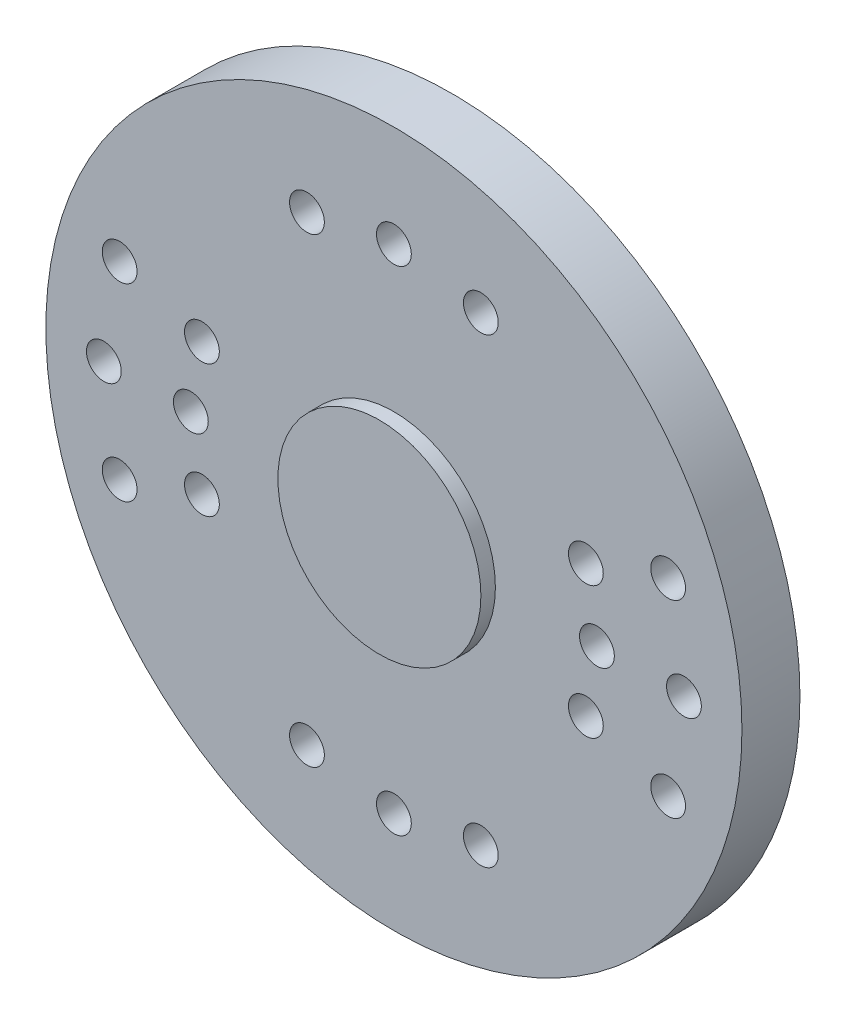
from build123d import *

# Parameters (mm, degrees)
ESQUISSE1_R             = 12
EXTRUSION1_DEPTH        = 2
ESQUISSE2_R             = 3.5
EXTRUSION2_DEPTH        = 0.5
ESQUISSE3_R             = 4.5
EXTRUSION3_DEPTH        = 2
ESQUISSE7_R             = 0.6
ENL_V_MAT_EXTRU_2_DEPTH = 18.435595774
ESQUISSE8_R             = 2.9
EXTRUSION4_DEPTH        = 2.7


with BuildPart() as part:
    # Esquisse1 → Extrusion1 (new body)
    with BuildSketch(Plane.XY):
        Circle(ESQUISSE1_R)
    extrude(amount=EXTRUSION1_DEPTH)

    # Esquisse2 → Extrusion2 (add)
    with BuildSketch(Plane.XY.offset(2)):
        Circle(ESQUISSE2_R)
    extrude(amount=EXTRUSION2_DEPTH)

    # Esquisse3 → Extrusion3 (add)
    with BuildSketch(Plane(origin=(0, 0, 0), x_dir=(-1, 0, 0), z_dir=(0, 0, -1))):
        with Locations(Location((0, 0, 0), (0, 0, 180))):
            Circle(ESQUISSE3_R)
    extrude(amount=EXTRUSION3_DEPTH)

    # Esquisse7 → Enl_v. mat.-Extru.2 (cut, through all)
    with BuildSketch(Plane.XY.offset(2)):
        with Locations((-2.997596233, 7.953893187)):
            Circle(ESQUISSE7_R)
        with Locations((0, 8.5)):
            Circle(ESQUISSE7_R)
        with Locations((2.997596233, 7.953893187)):
            Circle(ESQUISSE7_R)
        with Locations((-2.997596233, -7.953893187)):
            Circle(ESQUISSE7_R)
        with Locations((0, -8.5)):
            Circle(ESQUISSE7_R)
        with Locations((2.997596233, -7.953893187)):
            Circle(ESQUISSE7_R)
        with Locations((-6.618630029, 2.278977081)):
            Circle(ESQUISSE7_R)
        with Locations((-7, 0)):
            Circle(ESQUISSE7_R)
        with Locations((-6.618630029, -2.278977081)):
            Circle(ESQUISSE7_R)
        with Locations((-9.455185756, -3.255681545)):
            Circle(ESQUISSE7_R)
        with Locations((-10, 0)):
            Circle(ESQUISSE7_R)
        with Locations((-9.455185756, 3.255681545)):
            Circle(ESQUISSE7_R)
        with Locations((6.618630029, 2.278977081)):
            Circle(ESQUISSE7_R)
        with Locations((7, 0)):
            Circle(ESQUISSE7_R)
        with Locations((6.618630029, -2.278977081)):
            Circle(ESQUISSE7_R)
        with Locations((9.455185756, -3.255681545)):
            Circle(ESQUISSE7_R)
        with Locations((10, 0)):
            Circle(ESQUISSE7_R)
        with Locations((9.455185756, 3.255681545)):
            Circle(ESQUISSE7_R)
    extrude(amount=-ENL_V_MAT_EXTRU_2_DEPTH, mode=Mode.SUBTRACT)

    # Esquisse8 → Extrusion4 (cut)
    with BuildSketch(Plane(origin=(0, 0, -2), x_dir=(-1, 0, 0), z_dir=(0, 0, -1))):
        Circle(ESQUISSE8_R)
    extrude(amount=-EXTRUSION4_DEPTH, mode=Mode.SUBTRACT)


solid = part.part
